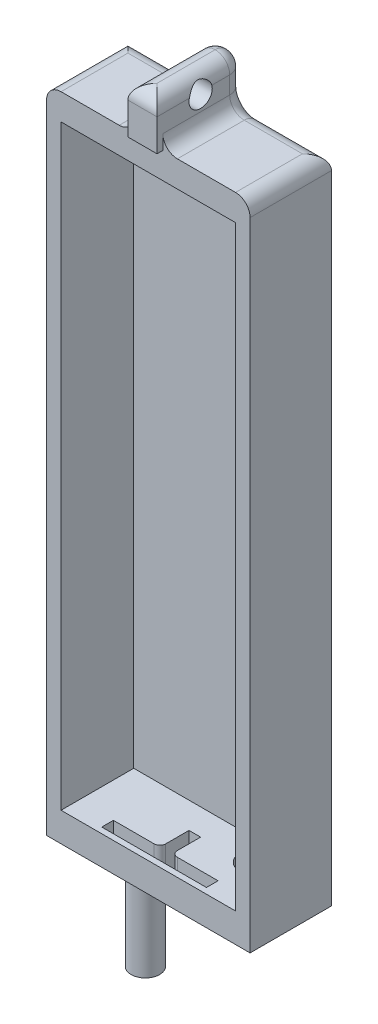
ISO-10303-21;
HEADER;
FILE_DESCRIPTION(('STEP AP214'),'2;1');
FILE_NAME('part.step','',(''),(''),'','','');
FILE_SCHEMA(('AUTOMOTIVE_DESIGN { 1 0 10303 214 1 1 1 1 }'));
ENDSEC;
DATA;
#1=APPLICATION_CONTEXT('core data for automotive mechanical design processes');
#2=APPLICATION_PROTOCOL_DEFINITION('international standard','automotive_design',2000,#1);
#3=PRODUCT_CONTEXT('',#1,'mechanical');
#4=PRODUCT('Part','Part','',(#3));
#5=PRODUCT_RELATED_PRODUCT_CATEGORY('part','',(#4));
#6=PRODUCT_DEFINITION_FORMATION('','',#4);
#7=PRODUCT_DEFINITION_CONTEXT('part definition',#1,'design');
#8=PRODUCT_DEFINITION('design','',#6,#7);
#9=PRODUCT_DEFINITION_SHAPE('','',#8);
#10=(LENGTH_UNIT() NAMED_UNIT(*) SI_UNIT(.MILLI.,.METRE.));
#11=(NAMED_UNIT(*) PLANE_ANGLE_UNIT() SI_UNIT($,.RADIAN.));
#12=(NAMED_UNIT(*) SI_UNIT($,.STERADIAN.) SOLID_ANGLE_UNIT());
#13=UNCERTAINTY_MEASURE_WITH_UNIT(LENGTH_MEASURE(1.E-05),#10,'distance_accuracy_value','');
#14=(GEOMETRIC_REPRESENTATION_CONTEXT(3) GLOBAL_UNCERTAINTY_ASSIGNED_CONTEXT((#13)) GLOBAL_UNIT_ASSIGNED_CONTEXT((#10,
#11,#12)) REPRESENTATION_CONTEXT('',''));
#15=CARTESIAN_POINT('',(0.,0.,0.));
#16=DIRECTION('',(0.,0.,1.));
#17=DIRECTION('',(1.,0.,0.));
#18=AXIS2_PLACEMENT_3D('',#15,#16,#17);
#19=CARTESIAN_POINT('',(0.,0.,15.));
#20=DIRECTION('',(0.,0.,-1.));
#21=DIRECTION('',(-1.,0.,0.));
#22=AXIS2_PLACEMENT_3D('',#19,#20,#21);
#23=PLANE('',#22);
#24=DIRECTION('',(0.,-1.,0.));
#25=VECTOR('',#24,1.);
#26=CARTESIAN_POINT('',(2.5,57.,15.));
#27=LINE('',#26,#25);
#28=CARTESIAN_POINT('',(2.5,62.5,15.));
#29=VERTEX_POINT('',#28);
#30=CARTESIAN_POINT('',(2.5,57.,15.));
#31=VERTEX_POINT('',#30);
#32=EDGE_CURVE('E363',#29,#31,#27,.T.);
#33=ORIENTED_EDGE('',*,*,#32,.F.);
#34=DIRECTION('',(1.,0.,0.));
#35=VECTOR('',#34,1.);
#36=CARTESIAN_POINT('',(-2.5,62.5,15.));
#37=LINE('',#36,#35);
#38=CARTESIAN_POINT('',(-2.5,62.5,15.));
#39=VERTEX_POINT('',#38);
#40=EDGE_CURVE('E717',#29,#39,#37,.F.);
#41=ORIENTED_EDGE('',*,*,#40,.T.);
#42=DIRECTION('',(0.,-1.,0.));
#43=VECTOR('',#42,1.);
#44=CARTESIAN_POINT('',(-2.5,57.,15.));
#45=LINE('',#44,#43);
#46=CARTESIAN_POINT('',(-2.5,57.,15.));
#47=VERTEX_POINT('',#46);
#48=EDGE_CURVE('E87',#39,#47,#45,.T.);
#49=ORIENTED_EDGE('',*,*,#48,.T.);
#50=DIRECTION('',(-1.,0.,0.));
#51=VECTOR('',#50,1.);
#52=CARTESIAN_POINT('',(-17.5,57.,15.));
#53=LINE('',#52,#51);
#54=EDGE_CURVE('E367',#31,#47,#53,.T.);
#55=ORIENTED_EDGE('',*,*,#54,.F.);
#56=EDGE_LOOP('',(#33,#41,#49,#55));
#57=FACE_BOUND('',#56,.T.);
#58=ADVANCED_FACE('F39',(#57),#23,.F.);
#59=CARTESIAN_POINT('',(-17.5,57.,14.));
#60=DIRECTION('',(0.,1.,0.));
#61=DIRECTION('',(0.,0.,1.));
#62=AXIS2_PLACEMENT_3D('',#59,#60,#61);
#63=PLANE('',#62);
#64=DIRECTION('',(0.,0.,-1.));
#65=VECTOR('',#64,1.);
#66=CARTESIAN_POINT('',(-2.5,57.,0.));
#67=LINE('',#66,#65);
#68=CARTESIAN_POINT('',(-2.5,57.,14.));
#69=VERTEX_POINT('',#68);
#70=EDGE_CURVE('E356',#47,#69,#67,.T.);
#71=ORIENTED_EDGE('',*,*,#70,.T.);
#72=DIRECTION('',(-1.,0.,0.));
#73=VECTOR('',#72,1.);
#74=CARTESIAN_POINT('',(-17.5,57.,14.));
#75=LINE('',#74,#73);
#76=CARTESIAN_POINT('',(2.5,57.,14.));
#77=VERTEX_POINT('',#76);
#78=EDGE_CURVE('E374',#77,#69,#75,.T.);
#79=ORIENTED_EDGE('',*,*,#78,.F.);
#80=DIRECTION('',(0.,0.,-1.));
#81=VECTOR('',#80,1.);
#82=CARTESIAN_POINT('',(2.5,57.,0.));
#83=LINE('',#82,#81);
#84=EDGE_CURVE('E365',#31,#77,#83,.T.);
#85=ORIENTED_EDGE('',*,*,#84,.F.);
#86=ORIENTED_EDGE('',*,*,#54,.T.);
#87=EDGE_LOOP('',(#71,#79,#85,#86));
#88=FACE_BOUND('',#87,.T.);
#89=ADVANCED_FACE('F578',(#88),#63,.F.);
#90=CARTESIAN_POINT('',(0.,0.,0.));
#91=DIRECTION('',(0.,0.,-1.));
#92=DIRECTION('',(-1.,0.,0.));
#93=AXIS2_PLACEMENT_3D('',#90,#91,#92);
#94=PLANE('',#93);
#95=DIRECTION('',(0.,-1.,0.));
#96=VECTOR('',#95,1.);
#97=CARTESIAN_POINT('',(-17.5,-55.,0.));
#98=LINE('',#97,#96);
#99=CARTESIAN_POINT('',(-17.5,54.5,0.));
#100=VERTEX_POINT('',#99);
#101=CARTESIAN_POINT('',(-17.5,-55.,0.));
#102=VERTEX_POINT('',#101);
#103=EDGE_CURVE('E470',#100,#102,#98,.T.);
#104=ORIENTED_EDGE('',*,*,#103,.F.);
#105=DIRECTION('',(-1.,0.,0.));
#106=VECTOR('',#105,1.);
#107=CARTESIAN_POINT('',(0.,54.5,0.));
#108=LINE('',#107,#106);
#109=CARTESIAN_POINT('',(-5.,54.5,0.));
#110=VERTEX_POINT('',#109);
#111=EDGE_CURVE('E527',#100,#110,#108,.F.);
#112=ORIENTED_EDGE('',*,*,#111,.T.);
#113=CARTESIAN_POINT('',(-5.,59.5,0.));
#114=DIRECTION('',(0.,0.,-1.));
#115=DIRECTION('',(-1.,0.,0.));
#116=AXIS2_PLACEMENT_3D('',#113,#114,#115);
#117=CIRCLE('',#116,5.);
#118=CARTESIAN_POINT('',(0.,59.5,0.));
#119=VERTEX_POINT('',#118);
#120=EDGE_CURVE('E524',#119,#110,#117,.T.);
#121=ORIENTED_EDGE('',*,*,#120,.F.);
#122=CARTESIAN_POINT('',(5.,59.5,0.));
#123=DIRECTION('',(0.,0.,-1.));
#124=DIRECTION('',(-1.,0.,0.));
#125=AXIS2_PLACEMENT_3D('',#122,#123,#124);
#126=CIRCLE('',#125,5.);
#127=CARTESIAN_POINT('',(5.,54.5,0.));
#128=VERTEX_POINT('',#127);
#129=EDGE_CURVE('E521',#128,#119,#126,.T.);
#130=ORIENTED_EDGE('',*,*,#129,.F.);
#131=DIRECTION('',(1.,0.,0.));
#132=VECTOR('',#131,1.);
#133=CARTESIAN_POINT('',(17.5,54.5,0.));
#134=LINE('',#133,#132);
#135=CARTESIAN_POINT('',(17.5,54.5,0.));
#136=VERTEX_POINT('',#135);
#137=EDGE_CURVE('E519',#128,#136,#134,.T.);
#138=ORIENTED_EDGE('',*,*,#137,.T.);
#139=DIRECTION('',(0.,1.,0.));
#140=VECTOR('',#139,1.);
#141=CARTESIAN_POINT('',(17.5,-55.,0.));
#142=LINE('',#141,#140);
#143=CARTESIAN_POINT('',(17.5,-55.,0.));
#144=VERTEX_POINT('',#143);
#145=EDGE_CURVE('E274',#144,#136,#142,.T.);
#146=ORIENTED_EDGE('',*,*,#145,.F.);
#147=DIRECTION('',(1.,0.,0.));
#148=VECTOR('',#147,1.);
#149=CARTESIAN_POINT('',(-17.5,-55.,0.));
#150=LINE('',#149,#148);
#151=EDGE_CURVE('E472',#102,#144,#150,.T.);
#152=ORIENTED_EDGE('',*,*,#151,.F.);
#153=EDGE_LOOP('',(#104,#112,#121,#130,#138,#146,#152));
#154=FACE_BOUND('',#153,.T.);
#155=ADVANCED_FACE('F581',(#154),#94,.T.);
#156=CARTESIAN_POINT('',(5.00000000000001,-50.,-106.800046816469));
#157=DIRECTION('',(0.,-1.,0.));
#158=DIRECTION('',(0.,0.,-1.));
#159=AXIS2_PLACEMENT_3D('',#156,#157,#158);
#160=PLANE('',#159);
#161=CARTESIAN_POINT('',(9.5,-50.,5.));
#162=DIRECTION('',(0.,-1.,0.));
#163=DIRECTION('',(0.,0.,-1.));
#164=AXIS2_PLACEMENT_3D('',#161,#162,#163);
#165=CIRCLE('',#164,2.75);
#166=CARTESIAN_POINT('',(9.5,-50.,2.25));
#167=VERTEX_POINT('',#166);
#168=EDGE_CURVE('E440',#167,#167,#165,.F.);
#169=ORIENTED_EDGE('',*,*,#168,.F.);
#170=EDGE_LOOP('',(#169));
#171=FACE_BOUND('',#170,.T.);
#172=DIRECTION('',(0.,0.,-1.));
#173=VECTOR('',#172,1.);
#174=CARTESIAN_POINT('',(1.,-50.,6.));
#175=LINE('',#174,#173);
#176=CARTESIAN_POINT('',(0.999999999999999,-50.,10.));
#177=VERTEX_POINT('',#176);
#178=CARTESIAN_POINT('',(1.,-50.,6.));
#179=VERTEX_POINT('',#178);
#180=EDGE_CURVE('E396',#177,#179,#175,.T.);
#181=ORIENTED_EDGE('',*,*,#180,.F.);
#182=CARTESIAN_POINT('',(2.,-50.,10.));
#183=DIRECTION('',(0.,-1.,0.));
#184=DIRECTION('',(0.,0.,-1.));
#185=AXIS2_PLACEMENT_3D('',#182,#183,#184);
#186=CIRCLE('',#185,1.);
#187=CARTESIAN_POINT('',(2.,-50.,11.));
#188=VERTEX_POINT('',#187);
#189=EDGE_CURVE('E491',#177,#188,#186,.F.);
#190=ORIENTED_EDGE('',*,*,#189,.T.);
#191=DIRECTION('',(-1.,0.,0.));
#192=VECTOR('',#191,1.);
#193=CARTESIAN_POINT('',(9.,-50.,11.));
#194=LINE('',#193,#192);
#195=CARTESIAN_POINT('',(9.,-50.,11.));
#196=VERTEX_POINT('',#195);
#197=EDGE_CURVE('E398',#196,#188,#194,.T.);
#198=ORIENTED_EDGE('',*,*,#197,.F.);
#199=DIRECTION('',(0.,0.,-1.));
#200=VECTOR('',#199,1.);
#201=CARTESIAN_POINT('',(9.,-50.,11.));
#202=LINE('',#201,#200);
#203=CARTESIAN_POINT('',(9.,-50.,13.));
#204=VERTEX_POINT('',#203);
#205=EDGE_CURVE('E401',#204,#196,#202,.T.);
#206=ORIENTED_EDGE('',*,*,#205,.F.);
#207=DIRECTION('',(1.,0.,0.));
#208=VECTOR('',#207,1.);
#209=CARTESIAN_POINT('',(9.,-50.,13.));
#210=LINE('',#209,#208);
#211=CARTESIAN_POINT('',(-9.,-50.,13.));
#212=VERTEX_POINT('',#211);
#213=EDGE_CURVE('E403',#212,#204,#210,.T.);
#214=ORIENTED_EDGE('',*,*,#213,.F.);
#215=DIRECTION('',(0.,0.,1.));
#216=VECTOR('',#215,1.);
#217=CARTESIAN_POINT('',(-9.,-50.,11.));
#218=LINE('',#217,#216);
#219=CARTESIAN_POINT('',(-9.,-50.,11.));
#220=VERTEX_POINT('',#219);
#221=EDGE_CURVE('E385',#220,#212,#218,.T.);
#222=ORIENTED_EDGE('',*,*,#221,.F.);
#223=DIRECTION('',(-1.,0.,0.));
#224=VECTOR('',#223,1.);
#225=CARTESIAN_POINT('',(-0.999999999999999,-50.,11.));
#226=LINE('',#225,#224);
#227=CARTESIAN_POINT('',(-2.,-50.,11.));
#228=VERTEX_POINT('',#227);
#229=EDGE_CURVE('E388',#228,#220,#226,.T.);
#230=ORIENTED_EDGE('',*,*,#229,.F.);
#231=CARTESIAN_POINT('',(-2.,-50.,10.));
#232=DIRECTION('',(0.,-1.,0.));
#233=DIRECTION('',(0.,0.,-1.));
#234=AXIS2_PLACEMENT_3D('',#231,#232,#233);
#235=CIRCLE('',#234,1.);
#236=CARTESIAN_POINT('',(-0.999999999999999,-50.,10.));
#237=VERTEX_POINT('',#236);
#238=EDGE_CURVE('E489',#228,#237,#235,.F.);
#239=ORIENTED_EDGE('',*,*,#238,.T.);
#240=DIRECTION('',(0.,0.,1.));
#241=VECTOR('',#240,1.);
#242=CARTESIAN_POINT('',(-1.,-50.,6.));
#243=LINE('',#242,#241);
#244=CARTESIAN_POINT('',(-1.,-50.,6.));
#245=VERTEX_POINT('',#244);
#246=EDGE_CURVE('E391',#245,#237,#243,.T.);
#247=ORIENTED_EDGE('',*,*,#246,.F.);
#248=DIRECTION('',(-1.,0.,0.));
#249=VECTOR('',#248,1.);
#250=CARTESIAN_POINT('',(1.,-50.,6.));
#251=LINE('',#250,#249);
#252=EDGE_CURVE('E394',#179,#245,#251,.T.);
#253=ORIENTED_EDGE('',*,*,#252,.F.);
#254=EDGE_LOOP('',(#181,#190,#198,#206,#214,#222,#230,#239,#247,#253));
#255=FACE_BOUND('',#254,.T.);
#256=DIRECTION('',(-1.,0.,0.));
#257=VECTOR('',#256,1.);
#258=CARTESIAN_POINT('',(5.00000000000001,-50.,14.));
#259=LINE('',#258,#257);
#260=CARTESIAN_POINT('',(15.,-50.,14.));
#261=VERTEX_POINT('',#260);
#262=CARTESIAN_POINT('',(-15.,-50.,14.));
#263=VERTEX_POINT('',#262);
#264=EDGE_CURVE('E382',#261,#263,#259,.T.);
#265=ORIENTED_EDGE('',*,*,#264,.F.);
#266=DIRECTION('',(0.,0.,1.));
#267=VECTOR('',#266,1.);
#268=CARTESIAN_POINT('',(15.,-50.,-106.800046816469));
#269=LINE('',#268,#267);
#270=CARTESIAN_POINT('',(15.,-50.,1.5));
#271=VERTEX_POINT('',#270);
#272=EDGE_CURVE('E448',#271,#261,#269,.T.);
#273=ORIENTED_EDGE('',*,*,#272,.F.);
#274=DIRECTION('',(1.,0.,0.));
#275=VECTOR('',#274,1.);
#276=CARTESIAN_POINT('',(5.00000000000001,-50.,1.5));
#277=LINE('',#276,#275);
#278=CARTESIAN_POINT('',(-15.,-50.,1.5));
#279=VERTEX_POINT('',#278);
#280=EDGE_CURVE('E443',#279,#271,#277,.T.);
#281=ORIENTED_EDGE('',*,*,#280,.F.);
#282=DIRECTION('',(0.,0.,1.));
#283=VECTOR('',#282,1.);
#284=CARTESIAN_POINT('',(-15.,-50.,-106.800046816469));
#285=LINE('',#284,#283);
#286=EDGE_CURVE('E452',#279,#263,#285,.T.);
#287=ORIENTED_EDGE('',*,*,#286,.T.);
#288=EDGE_LOOP('',(#265,#273,#281,#287));
#289=FACE_BOUND('',#288,.T.);
#290=ADVANCED_FACE('F632',(#171,#255,#289),#160,.F.);
#291=CARTESIAN_POINT('',(17.5,-55.,15.));
#292=DIRECTION('',(-1.,0.,0.));
#293=DIRECTION('',(0.,0.,1.));
#294=AXIS2_PLACEMENT_3D('',#291,#292,#293);
#295=PLANE('',#294);
#296=ORIENTED_EDGE('',*,*,#145,.T.);
#297=DIRECTION('',(0.,0.,1.));
#298=VECTOR('',#297,1.);
#299=CARTESIAN_POINT('',(17.5,54.5,15.));
#300=LINE('',#299,#298);
#301=CARTESIAN_POINT('',(17.5,54.5,14.));
#302=VERTEX_POINT('',#301);
#303=EDGE_CURVE('E268',#136,#302,#300,.T.);
#304=ORIENTED_EDGE('',*,*,#303,.T.);
#305=DIRECTION('',(0.,1.,0.));
#306=VECTOR('',#305,1.);
#307=CARTESIAN_POINT('',(17.5,57.,14.));
#308=LINE('',#307,#306);
#309=CARTESIAN_POINT('',(17.5,-55.,14.));
#310=VERTEX_POINT('',#309);
#311=EDGE_CURVE('E271',#310,#302,#308,.T.);
#312=ORIENTED_EDGE('',*,*,#311,.F.);
#313=DIRECTION('',(0.,0.,-1.));
#314=VECTOR('',#313,1.);
#315=CARTESIAN_POINT('',(17.5,-55.,15.));
#316=LINE('',#315,#314);
#317=EDGE_CURVE('E475',#310,#144,#316,.T.);
#318=ORIENTED_EDGE('',*,*,#317,.T.);
#319=EDGE_LOOP('',(#296,#304,#312,#318));
#320=FACE_BOUND('',#319,.T.);
#321=ADVANCED_FACE('F270',(#320),#295,.F.);
#322=CARTESIAN_POINT('',(-17.5,-55.,15.));
#323=DIRECTION('',(1.,0.,0.));
#324=DIRECTION('',(0.,0.,-1.));
#325=AXIS2_PLACEMENT_3D('',#322,#323,#324);
#326=PLANE('',#325);
#327=DIRECTION('',(0.,-1.,0.));
#328=VECTOR('',#327,1.);
#329=CARTESIAN_POINT('',(-17.5,57.,14.));
#330=LINE('',#329,#328);
#331=CARTESIAN_POINT('',(-17.5,54.5,14.));
#332=VERTEX_POINT('',#331);
#333=CARTESIAN_POINT('',(-17.5,-55.,14.));
#334=VERTEX_POINT('',#333);
#335=EDGE_CURVE('E368',#332,#334,#330,.T.);
#336=ORIENTED_EDGE('',*,*,#335,.F.);
#337=DIRECTION('',(0.,0.,-1.));
#338=VECTOR('',#337,1.);
#339=CARTESIAN_POINT('',(-17.5,54.5,0.));
#340=LINE('',#339,#338);
#341=EDGE_CURVE('E293',#332,#100,#340,.T.);
#342=ORIENTED_EDGE('',*,*,#341,.T.);
#343=ORIENTED_EDGE('',*,*,#103,.T.);
#344=DIRECTION('',(0.,0.,-1.));
#345=VECTOR('',#344,1.);
#346=CARTESIAN_POINT('',(-17.5,-55.,15.));
#347=LINE('',#346,#345);
#348=EDGE_CURVE('E477',#334,#102,#347,.T.);
#349=ORIENTED_EDGE('',*,*,#348,.F.);
#350=EDGE_LOOP('',(#336,#342,#343,#349));
#351=FACE_BOUND('',#350,.T.);
#352=ADVANCED_FACE('F646',(#351),#326,.F.);
#353=CARTESIAN_POINT('',(-17.5,-55.,15.));
#354=DIRECTION('',(0.,1.,0.));
#355=DIRECTION('',(0.,0.,1.));
#356=AXIS2_PLACEMENT_3D('',#353,#354,#355);
#357=PLANE('',#356);
#358=CARTESIAN_POINT('',(-9.5,-55.,5.));
#359=DIRECTION('',(0.,1.,0.));
#360=DIRECTION('',(0.,0.,1.));
#361=AXIS2_PLACEMENT_3D('',#358,#359,#360);
#362=CIRCLE('',#361,2.45);
#363=CARTESIAN_POINT('',(-9.5,-55.,7.45));
#364=VERTEX_POINT('',#363);
#365=EDGE_CURVE('E12',#364,#364,#362,.F.);
#366=ORIENTED_EDGE('',*,*,#365,.F.);
#367=EDGE_LOOP('',(#366));
#368=FACE_BOUND('',#367,.T.);
#369=CARTESIAN_POINT('',(9.5,-55.,5.));
#370=DIRECTION('',(0.,-1.,0.));
#371=DIRECTION('',(0.,0.,-1.));
#372=AXIS2_PLACEMENT_3D('',#369,#370,#371);
#373=CIRCLE('',#372,2.75);
#374=CARTESIAN_POINT('',(9.5,-55.,2.25));
#375=VERTEX_POINT('',#374);
#376=EDGE_CURVE('E439',#375,#375,#373,.T.);
#377=ORIENTED_EDGE('',*,*,#376,.F.);
#378=EDGE_LOOP('',(#377));
#379=FACE_BOUND('',#378,.T.);
#380=DIRECTION('',(1.,0.,0.));
#381=VECTOR('',#380,1.);
#382=CARTESIAN_POINT('',(9.,-55.,11.));
#383=LINE('',#382,#381);
#384=CARTESIAN_POINT('',(2.,-55.,11.));
#385=VERTEX_POINT('',#384);
#386=CARTESIAN_POINT('',(9.,-55.,11.));
#387=VERTEX_POINT('',#386);
#388=EDGE_CURVE('E422',#385,#387,#383,.T.);
#389=ORIENTED_EDGE('',*,*,#388,.F.);
#390=CARTESIAN_POINT('',(2.,-55.,10.));
#391=DIRECTION('',(0.,1.,0.));
#392=DIRECTION('',(0.,0.,1.));
#393=AXIS2_PLACEMENT_3D('',#390,#391,#392);
#394=CIRCLE('',#393,1.);
#395=CARTESIAN_POINT('',(0.999999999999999,-55.,10.));
#396=VERTEX_POINT('',#395);
#397=EDGE_CURVE('E485',#385,#396,#394,.F.);
#398=ORIENTED_EDGE('',*,*,#397,.T.);
#399=DIRECTION('',(0.,0.,1.));
#400=VECTOR('',#399,1.);
#401=CARTESIAN_POINT('',(1.,-55.,6.));
#402=LINE('',#401,#400);
#403=CARTESIAN_POINT('',(1.,-55.,6.));
#404=VERTEX_POINT('',#403);
#405=EDGE_CURVE('E419',#404,#396,#402,.T.);
#406=ORIENTED_EDGE('',*,*,#405,.F.);
#407=DIRECTION('',(1.,0.,0.));
#408=VECTOR('',#407,1.);
#409=CARTESIAN_POINT('',(1.,-55.,6.));
#410=LINE('',#409,#408);
#411=CARTESIAN_POINT('',(-1.,-55.,6.));
#412=VERTEX_POINT('',#411);
#413=EDGE_CURVE('E416',#412,#404,#410,.T.);
#414=ORIENTED_EDGE('',*,*,#413,.F.);
#415=DIRECTION('',(0.,0.,-1.));
#416=VECTOR('',#415,1.);
#417=CARTESIAN_POINT('',(-1.,-55.,6.));
#418=LINE('',#417,#416);
#419=CARTESIAN_POINT('',(-0.999999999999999,-55.,10.));
#420=VERTEX_POINT('',#419);
#421=EDGE_CURVE('E414',#420,#412,#418,.T.);
#422=ORIENTED_EDGE('',*,*,#421,.F.);
#423=CARTESIAN_POINT('',(-2.,-55.,10.));
#424=DIRECTION('',(0.,1.,0.));
#425=DIRECTION('',(0.,0.,1.));
#426=AXIS2_PLACEMENT_3D('',#423,#424,#425);
#427=CIRCLE('',#426,1.);
#428=CARTESIAN_POINT('',(-2.,-55.,11.));
#429=VERTEX_POINT('',#428);
#430=EDGE_CURVE('E483',#420,#429,#427,.F.);
#431=ORIENTED_EDGE('',*,*,#430,.T.);
#432=DIRECTION('',(1.,0.,0.));
#433=VECTOR('',#432,1.);
#434=CARTESIAN_POINT('',(-0.999999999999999,-55.,11.));
#435=LINE('',#434,#433);
#436=CARTESIAN_POINT('',(-9.,-55.,11.));
#437=VERTEX_POINT('',#436);
#438=EDGE_CURVE('E411',#437,#429,#435,.T.);
#439=ORIENTED_EDGE('',*,*,#438,.F.);
#440=DIRECTION('',(0.,0.,-1.));
#441=VECTOR('',#440,1.);
#442=CARTESIAN_POINT('',(-9.,-55.,11.));
#443=LINE('',#442,#441);
#444=CARTESIAN_POINT('',(-9.,-55.,13.));
#445=VERTEX_POINT('',#444);
#446=EDGE_CURVE('E408',#445,#437,#443,.T.);
#447=ORIENTED_EDGE('',*,*,#446,.F.);
#448=DIRECTION('',(-1.,0.,0.));
#449=VECTOR('',#448,1.);
#450=CARTESIAN_POINT('',(9.,-55.,13.));
#451=LINE('',#450,#449);
#452=CARTESIAN_POINT('',(9.,-55.,13.));
#453=VERTEX_POINT('',#452);
#454=EDGE_CURVE('E405',#453,#445,#451,.T.);
#455=ORIENTED_EDGE('',*,*,#454,.F.);
#456=DIRECTION('',(0.,0.,1.));
#457=VECTOR('',#456,1.);
#458=CARTESIAN_POINT('',(9.,-55.,11.));
#459=LINE('',#458,#457);
#460=EDGE_CURVE('E384',#387,#453,#459,.T.);
#461=ORIENTED_EDGE('',*,*,#460,.F.);
#462=EDGE_LOOP('',(#389,#398,#406,#414,#422,#431,#439,#447,#455,#461));
#463=FACE_BOUND('',#462,.T.);
#464=DIRECTION('',(1.,0.,0.));
#465=VECTOR('',#464,1.);
#466=CARTESIAN_POINT('',(-17.5,-55.,14.));
#467=LINE('',#466,#465);
#468=EDGE_CURVE('E288',#334,#310,#467,.T.);
#469=ORIENTED_EDGE('',*,*,#468,.F.);
#470=ORIENTED_EDGE('',*,*,#348,.T.);
#471=ORIENTED_EDGE('',*,*,#151,.T.);
#472=ORIENTED_EDGE('',*,*,#317,.F.);
#473=EDGE_LOOP('',(#469,#470,#471,#472));
#474=FACE_BOUND('',#473,.T.);
#475=ADVANCED_FACE('F630',(#368,#379,#463,#474),#357,.F.);
#476=CARTESIAN_POINT('',(15.,52.5,-106.800046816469));
#477=DIRECTION('',(1.,0.,0.));
#478=DIRECTION('',(0.,1.,0.));
#479=AXIS2_PLACEMENT_3D('',#476,#477,#478);
#480=PLANE('',#479);
#481=DIRECTION('',(0.,-1.,0.));
#482=VECTOR('',#481,1.);
#483=CARTESIAN_POINT('',(15.,52.5,14.));
#484=LINE('',#483,#482);
#485=CARTESIAN_POINT('',(15.,52.5,14.));
#486=VERTEX_POINT('',#485);
#487=EDGE_CURVE('E380',#486,#261,#484,.T.);
#488=ORIENTED_EDGE('',*,*,#487,.F.);
#489=DIRECTION('',(0.,0.,1.));
#490=VECTOR('',#489,1.);
#491=CARTESIAN_POINT('',(15.,52.5,-106.800046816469));
#492=LINE('',#491,#490);
#493=CARTESIAN_POINT('',(15.,52.5,1.5));
#494=VERTEX_POINT('',#493);
#495=EDGE_CURVE('E457',#494,#486,#492,.T.);
#496=ORIENTED_EDGE('',*,*,#495,.F.);
#497=DIRECTION('',(0.,1.,0.));
#498=VECTOR('',#497,1.);
#499=CARTESIAN_POINT('',(15.,52.5,1.5));
#500=LINE('',#499,#498);
#501=EDGE_CURVE('E458',#271,#494,#500,.T.);
#502=ORIENTED_EDGE('',*,*,#501,.F.);
#503=ORIENTED_EDGE('',*,*,#272,.T.);
#504=EDGE_LOOP('',(#488,#496,#502,#503));
#505=FACE_BOUND('',#504,.T.);
#506=ADVANCED_FACE('F626',(#505),#480,.F.);
#507=CARTESIAN_POINT('',(-15.,52.5,-106.800046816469));
#508=DIRECTION('',(0.,1.,0.));
#509=DIRECTION('',(0.,0.,1.));
#510=AXIS2_PLACEMENT_3D('',#507,#508,#509);
#511=PLANE('',#510);
#512=DIRECTION('',(1.,0.,0.));
#513=VECTOR('',#512,1.);
#514=CARTESIAN_POINT('',(-15.,52.5,14.));
#515=LINE('',#514,#513);
#516=CARTESIAN_POINT('',(-15.,52.5,14.));
#517=VERTEX_POINT('',#516);
#518=EDGE_CURVE('E378',#517,#486,#515,.T.);
#519=ORIENTED_EDGE('',*,*,#518,.F.);
#520=DIRECTION('',(0.,0.,1.));
#521=VECTOR('',#520,1.);
#522=CARTESIAN_POINT('',(-15.,52.5,-106.800046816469));
#523=LINE('',#522,#521);
#524=CARTESIAN_POINT('',(-15.,52.5,1.5));
#525=VERTEX_POINT('',#524);
#526=EDGE_CURVE('E453',#525,#517,#523,.T.);
#527=ORIENTED_EDGE('',*,*,#526,.F.);
#528=DIRECTION('',(-1.,0.,0.));
#529=VECTOR('',#528,1.);
#530=CARTESIAN_POINT('',(-15.,52.5,1.5));
#531=LINE('',#530,#529);
#532=EDGE_CURVE('E454',#494,#525,#531,.T.);
#533=ORIENTED_EDGE('',*,*,#532,.F.);
#534=ORIENTED_EDGE('',*,*,#495,.T.);
#535=EDGE_LOOP('',(#519,#527,#533,#534));
#536=FACE_BOUND('',#535,.T.);
#537=ADVANCED_FACE('F622',(#536),#511,.F.);
#538=CARTESIAN_POINT('',(-15.,52.5,-106.800046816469));
#539=DIRECTION('',(-1.,0.,0.));
#540=DIRECTION('',(0.,-1.,0.));
#541=AXIS2_PLACEMENT_3D('',#538,#539,#540);
#542=PLANE('',#541);
#543=DIRECTION('',(0.,1.,0.));
#544=VECTOR('',#543,1.);
#545=CARTESIAN_POINT('',(-15.,52.5,14.));
#546=LINE('',#545,#544);
#547=EDGE_CURVE('E373',#263,#517,#546,.T.);
#548=ORIENTED_EDGE('',*,*,#547,.F.);
#549=ORIENTED_EDGE('',*,*,#286,.F.);
#550=DIRECTION('',(0.,-1.,0.));
#551=VECTOR('',#550,1.);
#552=CARTESIAN_POINT('',(-15.,52.5,1.5));
#553=LINE('',#552,#551);
#554=EDGE_CURVE('E449',#525,#279,#553,.T.);
#555=ORIENTED_EDGE('',*,*,#554,.F.);
#556=ORIENTED_EDGE('',*,*,#526,.T.);
#557=EDGE_LOOP('',(#548,#549,#555,#556));
#558=FACE_BOUND('',#557,.T.);
#559=ADVANCED_FACE('F619',(#558),#542,.F.);
#560=CARTESIAN_POINT('',(0.,0.,1.5));
#561=DIRECTION('',(0.,0.,-1.));
#562=DIRECTION('',(-1.,0.,0.));
#563=AXIS2_PLACEMENT_3D('',#560,#561,#562);
#564=PLANE('',#563);
#565=ORIENTED_EDGE('',*,*,#554,.T.);
#566=ORIENTED_EDGE('',*,*,#280,.T.);
#567=ORIENTED_EDGE('',*,*,#501,.T.);
#568=ORIENTED_EDGE('',*,*,#532,.T.);
#569=EDGE_LOOP('',(#565,#566,#567,#568));
#570=FACE_BOUND('',#569,.T.);
#571=ADVANCED_FACE('F617',(#570),#564,.F.);
#572=CARTESIAN_POINT('',(9.5,-55.,5.));
#573=DIRECTION('',(0.,-1.,0.));
#574=DIRECTION('',(0.,0.,-1.));
#575=AXIS2_PLACEMENT_3D('',#572,#573,#574);
#576=CYLINDRICAL_SURFACE('',#575,2.75);
#577=ORIENTED_EDGE('',*,*,#168,.T.);
#578=EDGE_LOOP('',(#577));
#579=FACE_BOUND('',#578,.T.);
#580=ORIENTED_EDGE('',*,*,#376,.T.);
#581=EDGE_LOOP('',(#580));
#582=FACE_BOUND('',#581,.T.);
#583=ADVANCED_FACE('F613',(#579,#582),#576,.F.);
#584=CARTESIAN_POINT('',(9.,-30.6867920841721,11.));
#585=DIRECTION('',(1.,0.,0.));
#586=DIRECTION('',(0.,0.,-1.));
#587=AXIS2_PLACEMENT_3D('',#584,#585,#586);
#588=PLANE('',#587);
#589=ORIENTED_EDGE('',*,*,#205,.T.);
#590=DIRECTION('',(0.,-1.,0.));
#591=VECTOR('',#590,1.);
#592=CARTESIAN_POINT('',(9.,-30.6867920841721,11.));
#593=LINE('',#592,#591);
#594=EDGE_CURVE('E389',#196,#387,#593,.T.);
#595=ORIENTED_EDGE('',*,*,#594,.T.);
#596=ORIENTED_EDGE('',*,*,#460,.T.);
#597=DIRECTION('',(0.,-1.,0.));
#598=VECTOR('',#597,1.);
#599=CARTESIAN_POINT('',(9.,-30.6867920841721,13.));
#600=LINE('',#599,#598);
#601=EDGE_CURVE('E424',#204,#453,#600,.T.);
#602=ORIENTED_EDGE('',*,*,#601,.F.);
#603=EDGE_LOOP('',(#589,#595,#596,#602));
#604=FACE_BOUND('',#603,.T.);
#605=ADVANCED_FACE('F587',(#604),#588,.F.);
#606=CARTESIAN_POINT('',(9.,-30.6867920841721,11.));
#607=DIRECTION('',(0.,0.,-1.));
#608=DIRECTION('',(-1.,0.,0.));
#609=AXIS2_PLACEMENT_3D('',#606,#607,#608);
#610=PLANE('',#609);
#611=ORIENTED_EDGE('',*,*,#197,.T.);
#612=DIRECTION('',(0.,-1.,0.));
#613=VECTOR('',#612,1.);
#614=CARTESIAN_POINT('',(2.,-30.6867920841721,11.));
#615=LINE('',#614,#613);
#616=EDGE_CURVE('E480',#188,#385,#615,.T.);
#617=ORIENTED_EDGE('',*,*,#616,.T.);
#618=ORIENTED_EDGE('',*,*,#388,.T.);
#619=ORIENTED_EDGE('',*,*,#594,.F.);
#620=EDGE_LOOP('',(#611,#617,#618,#619));
#621=FACE_BOUND('',#620,.T.);
#622=ADVANCED_FACE('F583',(#621),#610,.F.);
#623=CARTESIAN_POINT('',(1.,-30.6867920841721,6.));
#624=DIRECTION('',(1.,0.,0.));
#625=DIRECTION('',(0.,0.,-1.));
#626=AXIS2_PLACEMENT_3D('',#623,#624,#625);
#627=PLANE('',#626);
#628=ORIENTED_EDGE('',*,*,#405,.T.);
#629=DIRECTION('',(0.,-1.,0.));
#630=VECTOR('',#629,1.);
#631=CARTESIAN_POINT('',(0.999999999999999,-30.6867920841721,10.));
#632=LINE('',#631,#630);
#633=EDGE_CURVE('E487',#396,#177,#632,.F.);
#634=ORIENTED_EDGE('',*,*,#633,.T.);
#635=ORIENTED_EDGE('',*,*,#180,.T.);
#636=DIRECTION('',(0.,-1.,0.));
#637=VECTOR('',#636,1.);
#638=CARTESIAN_POINT('',(1.,-30.6867920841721,6.));
#639=LINE('',#638,#637);
#640=EDGE_CURVE('E427',#179,#404,#639,.T.);
#641=ORIENTED_EDGE('',*,*,#640,.T.);
#642=EDGE_LOOP('',(#628,#634,#635,#641));
#643=FACE_BOUND('',#642,.T.);
#644=ADVANCED_FACE('F586',(#643),#627,.F.);
#645=CARTESIAN_POINT('',(1.,-30.6867920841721,6.));
#646=DIRECTION('',(0.,0.,-1.));
#647=DIRECTION('',(-1.,0.,0.));
#648=AXIS2_PLACEMENT_3D('',#645,#646,#647);
#649=PLANE('',#648);
#650=ORIENTED_EDGE('',*,*,#252,.T.);
#651=DIRECTION('',(0.,-1.,0.));
#652=VECTOR('',#651,1.);
#653=CARTESIAN_POINT('',(-1.,-30.6867920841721,6.));
#654=LINE('',#653,#652);
#655=EDGE_CURVE('E429',#245,#412,#654,.T.);
#656=ORIENTED_EDGE('',*,*,#655,.T.);
#657=ORIENTED_EDGE('',*,*,#413,.T.);
#658=ORIENTED_EDGE('',*,*,#640,.F.);
#659=EDGE_LOOP('',(#650,#656,#657,#658));
#660=FACE_BOUND('',#659,.T.);
#661=ADVANCED_FACE('F591',(#660),#649,.F.);
#662=CARTESIAN_POINT('',(-1.,-30.6867920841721,6.));
#663=DIRECTION('',(-1.,0.,0.));
#664=DIRECTION('',(0.,0.,1.));
#665=AXIS2_PLACEMENT_3D('',#662,#663,#664);
#666=PLANE('',#665);
#667=ORIENTED_EDGE('',*,*,#246,.T.);
#668=DIRECTION('',(0.,-1.,0.));
#669=VECTOR('',#668,1.);
#670=CARTESIAN_POINT('',(-0.999999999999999,-30.6867920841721,10.));
#671=LINE('',#670,#669);
#672=EDGE_CURVE('E493',#237,#420,#671,.T.);
#673=ORIENTED_EDGE('',*,*,#672,.T.);
#674=ORIENTED_EDGE('',*,*,#421,.T.);
#675=ORIENTED_EDGE('',*,*,#655,.F.);
#676=EDGE_LOOP('',(#667,#673,#674,#675));
#677=FACE_BOUND('',#676,.T.);
#678=ADVANCED_FACE('F595',(#677),#666,.F.);
#679=CARTESIAN_POINT('',(-0.999999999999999,-30.6867920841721,11.));
#680=DIRECTION('',(0.,0.,-1.));
#681=DIRECTION('',(-1.,0.,0.));
#682=AXIS2_PLACEMENT_3D('',#679,#680,#681);
#683=PLANE('',#682);
#684=ORIENTED_EDGE('',*,*,#438,.T.);
#685=DIRECTION('',(0.,-1.,0.));
#686=VECTOR('',#685,1.);
#687=CARTESIAN_POINT('',(-2.,-30.6867920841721,11.));
#688=LINE('',#687,#686);
#689=EDGE_CURVE('E496',#429,#228,#688,.F.);
#690=ORIENTED_EDGE('',*,*,#689,.T.);
#691=ORIENTED_EDGE('',*,*,#229,.T.);
#692=DIRECTION('',(0.,-1.,0.));
#693=VECTOR('',#692,1.);
#694=CARTESIAN_POINT('',(-9.,-30.6867920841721,11.));
#695=LINE('',#694,#693);
#696=EDGE_CURVE('E432',#220,#437,#695,.T.);
#697=ORIENTED_EDGE('',*,*,#696,.T.);
#698=EDGE_LOOP('',(#684,#690,#691,#697));
#699=FACE_BOUND('',#698,.T.);
#700=ADVANCED_FACE('F599',(#699),#683,.F.);
#701=CARTESIAN_POINT('',(-9.,-30.6867920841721,11.));
#702=DIRECTION('',(-1.,0.,0.));
#703=DIRECTION('',(0.,0.,1.));
#704=AXIS2_PLACEMENT_3D('',#701,#702,#703);
#705=PLANE('',#704);
#706=ORIENTED_EDGE('',*,*,#221,.T.);
#707=DIRECTION('',(0.,-1.,0.));
#708=VECTOR('',#707,1.);
#709=CARTESIAN_POINT('',(-9.,-30.6867920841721,13.));
#710=LINE('',#709,#708);
#711=EDGE_CURVE('E434',#212,#445,#710,.T.);
#712=ORIENTED_EDGE('',*,*,#711,.T.);
#713=ORIENTED_EDGE('',*,*,#446,.T.);
#714=ORIENTED_EDGE('',*,*,#696,.F.);
#715=EDGE_LOOP('',(#706,#712,#713,#714));
#716=FACE_BOUND('',#715,.T.);
#717=ADVANCED_FACE('F603',(#716),#705,.F.);
#718=CARTESIAN_POINT('',(9.,-30.6867920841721,13.));
#719=DIRECTION('',(0.,0.,1.));
#720=DIRECTION('',(1.,0.,0.));
#721=AXIS2_PLACEMENT_3D('',#718,#719,#720);
#722=PLANE('',#721);
#723=ORIENTED_EDGE('',*,*,#213,.T.);
#724=ORIENTED_EDGE('',*,*,#601,.T.);
#725=ORIENTED_EDGE('',*,*,#454,.T.);
#726=ORIENTED_EDGE('',*,*,#711,.F.);
#727=EDGE_LOOP('',(#723,#724,#725,#726));
#728=FACE_BOUND('',#727,.T.);
#729=ADVANCED_FACE('F577',(#728),#722,.F.);
#730=CARTESIAN_POINT('',(0.,0.,14.));
#731=DIRECTION('',(0.,0.,1.));
#732=DIRECTION('',(1.,0.,0.));
#733=AXIS2_PLACEMENT_3D('',#730,#731,#732);
#734=PLANE('',#733);
#735=ORIENTED_EDGE('',*,*,#311,.T.);
#736=CARTESIAN_POINT('',(15.,54.5,14.));
#737=DIRECTION('',(0.,0.,1.));
#738=DIRECTION('',(1.,0.,0.));
#739=AXIS2_PLACEMENT_3D('',#736,#737,#738);
#740=CIRCLE('',#739,2.5);
#741=CARTESIAN_POINT('',(15.,57.,14.));
#742=VERTEX_POINT('',#741);
#743=EDGE_CURVE('E285',#302,#742,#740,.T.);
#744=ORIENTED_EDGE('',*,*,#743,.T.);
#745=CARTESIAN_POINT('',(5.,57.,14.));
#746=VERTEX_POINT('',#745);
#747=EDGE_CURVE('E371',#742,#746,#75,.T.);
#748=ORIENTED_EDGE('',*,*,#747,.T.);
#749=CARTESIAN_POINT('',(5.,59.5,14.));
#750=DIRECTION('',(0.,0.,1.));
#751=DIRECTION('',(1.,0.,0.));
#752=AXIS2_PLACEMENT_3D('',#749,#750,#751);
#753=CIRCLE('',#752,2.5);
#754=CARTESIAN_POINT('',(2.5,59.5,14.));
#755=VERTEX_POINT('',#754);
#756=EDGE_CURVE('E295',#746,#755,#753,.F.);
#757=ORIENTED_EDGE('',*,*,#756,.T.);
#758=DIRECTION('',(0.,1.,0.));
#759=VECTOR('',#758,1.);
#760=CARTESIAN_POINT('',(2.5,0.,14.));
#761=LINE('',#760,#759);
#762=EDGE_CURVE('E56',#77,#755,#761,.T.);
#763=ORIENTED_EDGE('',*,*,#762,.F.);
#764=ORIENTED_EDGE('',*,*,#78,.T.);
#765=DIRECTION('',(0.,-1.,0.));
#766=VECTOR('',#765,1.);
#767=CARTESIAN_POINT('',(-2.5,0.,14.));
#768=LINE('',#767,#766);
#769=CARTESIAN_POINT('',(-2.5,59.5,14.));
#770=VERTEX_POINT('',#769);
#771=EDGE_CURVE('E498',#770,#69,#768,.T.);
#772=ORIENTED_EDGE('',*,*,#771,.F.);
#773=CARTESIAN_POINT('',(-5.,59.5,14.));
#774=DIRECTION('',(0.,0.,1.));
#775=DIRECTION('',(1.,0.,0.));
#776=AXIS2_PLACEMENT_3D('',#773,#774,#775);
#777=CIRCLE('',#776,2.5);
#778=CARTESIAN_POINT('',(-5.,57.,14.));
#779=VERTEX_POINT('',#778);
#780=EDGE_CURVE('E48',#770,#779,#777,.F.);
#781=ORIENTED_EDGE('',*,*,#780,.T.);
#782=CARTESIAN_POINT('',(-15.,57.,14.));
#783=VERTEX_POINT('',#782);
#784=EDGE_CURVE('E289',#779,#783,#75,.T.);
#785=ORIENTED_EDGE('',*,*,#784,.T.);
#786=CARTESIAN_POINT('',(-15.,54.5,14.));
#787=DIRECTION('',(0.,0.,1.));
#788=DIRECTION('',(1.,0.,0.));
#789=AXIS2_PLACEMENT_3D('',#786,#787,#788);
#790=CIRCLE('',#789,2.5);
#791=EDGE_CURVE('E279',#783,#332,#790,.T.);
#792=ORIENTED_EDGE('',*,*,#791,.T.);
#793=ORIENTED_EDGE('',*,*,#335,.T.);
#794=ORIENTED_EDGE('',*,*,#468,.T.);
#795=EDGE_LOOP('',(#735,#744,#748,#757,#763,#764,#772,#781,#785,#792,#793,#794));
#796=FACE_BOUND('',#795,.T.);
#797=ORIENTED_EDGE('',*,*,#264,.T.);
#798=ORIENTED_EDGE('',*,*,#547,.T.);
#799=ORIENTED_EDGE('',*,*,#518,.T.);
#800=ORIENTED_EDGE('',*,*,#487,.T.);
#801=EDGE_LOOP('',(#797,#798,#799,#800));
#802=FACE_BOUND('',#801,.T.);
#803=ADVANCED_FACE('F282',(#796,#802),#734,.T.);
#804=CARTESIAN_POINT('',(2.,-30.6867920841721,10.));
#805=DIRECTION('',(0.,-1.,0.));
#806=DIRECTION('',(0.,0.,-1.));
#807=AXIS2_PLACEMENT_3D('',#804,#805,#806);
#808=CYLINDRICAL_SURFACE('',#807,1.);
#809=ORIENTED_EDGE('',*,*,#189,.F.);
#810=ORIENTED_EDGE('',*,*,#633,.F.);
#811=ORIENTED_EDGE('',*,*,#397,.F.);
#812=ORIENTED_EDGE('',*,*,#616,.F.);
#813=EDGE_LOOP('',(#809,#810,#811,#812));
#814=FACE_BOUND('',#813,.T.);
#815=ADVANCED_FACE('F576',(#814),#808,.T.);
#816=CARTESIAN_POINT('',(-2.,-30.6867920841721,10.));
#817=DIRECTION('',(0.,-1.,0.));
#818=DIRECTION('',(0.,0.,-1.));
#819=AXIS2_PLACEMENT_3D('',#816,#817,#818);
#820=CYLINDRICAL_SURFACE('',#819,1.);
#821=ORIENTED_EDGE('',*,*,#238,.F.);
#822=ORIENTED_EDGE('',*,*,#689,.F.);
#823=ORIENTED_EDGE('',*,*,#430,.F.);
#824=ORIENTED_EDGE('',*,*,#672,.F.);
#825=EDGE_LOOP('',(#821,#822,#823,#824));
#826=FACE_BOUND('',#825,.T.);
#827=ADVANCED_FACE('F572',(#826),#820,.T.);
#828=CARTESIAN_POINT('',(2.5,57.,0.));
#829=DIRECTION('',(0.,-1.,0.));
#830=DIRECTION('',(0.,0.,-1.));
#831=AXIS2_PLACEMENT_3D('',#828,#829,#830);
#832=PLANE('',#831);
#833=DIRECTION('',(1.,0.,0.));
#834=VECTOR('',#833,1.);
#835=CARTESIAN_POINT('',(2.5,57.,2.5));
#836=LINE('',#835,#834);
#837=CARTESIAN_POINT('',(15.,57.,2.5));
#838=VERTEX_POINT('',#837);
#839=CARTESIAN_POINT('',(5.,57.,2.5));
#840=VERTEX_POINT('',#839);
#841=EDGE_CURVE('E710',#838,#840,#836,.F.);
#842=ORIENTED_EDGE('',*,*,#841,.T.);
#843=DIRECTION('',(0.,0.,-1.));
#844=VECTOR('',#843,1.);
#845=CARTESIAN_POINT('',(5.,57.,0.));
#846=LINE('',#845,#844);
#847=EDGE_CURVE('E280',#840,#746,#846,.F.);
#848=ORIENTED_EDGE('',*,*,#847,.T.);
#849=ORIENTED_EDGE('',*,*,#747,.F.);
#850=DIRECTION('',(0.,0.,1.));
#851=VECTOR('',#850,1.);
#852=CARTESIAN_POINT('',(15.,57.,0.));
#853=LINE('',#852,#851);
#854=EDGE_CURVE('E292',#742,#838,#853,.F.);
#855=ORIENTED_EDGE('',*,*,#854,.T.);
#856=EDGE_LOOP('',(#842,#848,#849,#855));
#857=FACE_BOUND('',#856,.T.);
#858=ADVANCED_FACE('F568',(#857),#832,.F.);
#859=CARTESIAN_POINT('',(2.5,0.,0.));
#860=DIRECTION('',(1.,0.,0.));
#861=DIRECTION('',(0.,0.,-1.));
#862=AXIS2_PLACEMENT_3D('',#859,#860,#861);
#863=PLANE('',#862);
#864=CARTESIAN_POINT('',(2.5,62.,7.5));
#865=DIRECTION('',(1.,0.,0.));
#866=DIRECTION('',(0.,0.,-1.));
#867=AXIS2_PLACEMENT_3D('',#864,#865,#866);
#868=CIRCLE('',#867,2.);
#869=CARTESIAN_POINT('',(2.5,62.5,9.43649167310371));
#870=VERTEX_POINT('',#869);
#871=CARTESIAN_POINT('',(2.5,62.5,5.56350832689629));
#872=VERTEX_POINT('',#871);
#873=EDGE_CURVE('E350',#870,#872,#868,.T.);
#874=ORIENTED_EDGE('',*,*,#873,.F.);
#875=DIRECTION('',(0.,0.,1.));
#876=VECTOR('',#875,1.);
#877=CARTESIAN_POINT('',(2.5,62.5,0.));
#878=LINE('',#877,#876);
#879=EDGE_CURVE('E517',#870,#29,#878,.T.);
#880=ORIENTED_EDGE('',*,*,#879,.T.);
#881=ORIENTED_EDGE('',*,*,#32,.T.);
#882=ORIENTED_EDGE('',*,*,#84,.T.);
#883=ORIENTED_EDGE('',*,*,#762,.T.);
#884=DIRECTION('',(0.,0.,-1.));
#885=VECTOR('',#884,1.);
#886=CARTESIAN_POINT('',(2.5,59.5,0.));
#887=LINE('',#886,#885);
#888=CARTESIAN_POINT('',(2.5,59.5,2.5));
#889=VERTEX_POINT('',#888);
#890=EDGE_CURVE('E511',#755,#889,#887,.T.);
#891=ORIENTED_EDGE('',*,*,#890,.T.);
#892=DIRECTION('',(0.,1.,0.));
#893=VECTOR('',#892,1.);
#894=CARTESIAN_POINT('',(2.5,0.,2.5));
#895=LINE('',#894,#893);
#896=CARTESIAN_POINT('',(2.5,62.5,2.5));
#897=VERTEX_POINT('',#896);
#898=EDGE_CURVE('E513',#889,#897,#895,.T.);
#899=ORIENTED_EDGE('',*,*,#898,.T.);
#900=DIRECTION('',(0.,0.,1.));
#901=VECTOR('',#900,1.);
#902=CARTESIAN_POINT('',(2.5,62.5,0.));
#903=LINE('',#902,#901);
#904=EDGE_CURVE('E515',#897,#872,#903,.T.);
#905=ORIENTED_EDGE('',*,*,#904,.T.);
#906=EDGE_LOOP('',(#874,#880,#881,#882,#883,#891,#899,#905));
#907=FACE_BOUND('',#906,.T.);
#908=ADVANCED_FACE('F564',(#907),#863,.T.);
#909=CARTESIAN_POINT('',(-2.5,57.,0.));
#910=DIRECTION('',(0.,1.,0.));
#911=DIRECTION('',(0.,0.,1.));
#912=AXIS2_PLACEMENT_3D('',#909,#910,#911);
#913=PLANE('',#912);
#914=DIRECTION('',(-1.,0.,0.));
#915=VECTOR('',#914,1.);
#916=CARTESIAN_POINT('',(-2.5,57.,2.5));
#917=LINE('',#916,#915);
#918=CARTESIAN_POINT('',(-5.,57.,2.5));
#919=VERTEX_POINT('',#918);
#920=CARTESIAN_POINT('',(-15.,57.,2.5));
#921=VERTEX_POINT('',#920);
#922=EDGE_CURVE('E686',#919,#921,#917,.T.);
#923=ORIENTED_EDGE('',*,*,#922,.T.);
#924=DIRECTION('',(0.,0.,-1.));
#925=VECTOR('',#924,1.);
#926=CARTESIAN_POINT('',(-15.,57.,14.));
#927=LINE('',#926,#925);
#928=EDGE_CURVE('E689',#921,#783,#927,.F.);
#929=ORIENTED_EDGE('',*,*,#928,.T.);
#930=ORIENTED_EDGE('',*,*,#784,.F.);
#931=DIRECTION('',(0.,0.,-1.));
#932=VECTOR('',#931,1.);
#933=CARTESIAN_POINT('',(-5.,57.,0.));
#934=LINE('',#933,#932);
#935=EDGE_CURVE('E690',#779,#919,#934,.T.);
#936=ORIENTED_EDGE('',*,*,#935,.T.);
#937=EDGE_LOOP('',(#923,#929,#930,#936));
#938=FACE_BOUND('',#937,.T.);
#939=ADVANCED_FACE('F560',(#938),#913,.T.);
#940=CARTESIAN_POINT('',(-2.5,0.,0.));
#941=DIRECTION('',(-1.,0.,0.));
#942=DIRECTION('',(0.,0.,-1.));
#943=AXIS2_PLACEMENT_3D('',#940,#941,#942);
#944=PLANE('',#943);
#945=ORIENTED_EDGE('',*,*,#48,.F.);
#946=DIRECTION('',(0.,0.,1.));
#947=VECTOR('',#946,1.);
#948=CARTESIAN_POINT('',(-2.5,62.5,0.));
#949=LINE('',#948,#947);
#950=CARTESIAN_POINT('',(-2.5,62.5,9.43649167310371));
#951=VERTEX_POINT('',#950);
#952=EDGE_CURVE('E508',#39,#951,#949,.F.);
#953=ORIENTED_EDGE('',*,*,#952,.T.);
#954=CARTESIAN_POINT('',(-2.5,62.,7.5));
#955=DIRECTION('',(-1.,0.,0.));
#956=DIRECTION('',(0.,0.,1.));
#957=AXIS2_PLACEMENT_3D('',#954,#955,#956);
#958=CIRCLE('',#957,2.);
#959=CARTESIAN_POINT('',(-2.5,62.5,5.56350832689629));
#960=VERTEX_POINT('',#959);
#961=EDGE_CURVE('E345',#960,#951,#958,.T.);
#962=ORIENTED_EDGE('',*,*,#961,.F.);
#963=DIRECTION('',(0.,0.,1.));
#964=VECTOR('',#963,1.);
#965=CARTESIAN_POINT('',(-2.5,62.5,0.));
#966=LINE('',#965,#964);
#967=CARTESIAN_POINT('',(-2.5,62.5,2.5));
#968=VERTEX_POINT('',#967);
#969=EDGE_CURVE('E506',#960,#968,#966,.F.);
#970=ORIENTED_EDGE('',*,*,#969,.T.);
#971=DIRECTION('',(0.,1.,0.));
#972=VECTOR('',#971,1.);
#973=CARTESIAN_POINT('',(-2.5,0.,2.5));
#974=LINE('',#973,#972);
#975=CARTESIAN_POINT('',(-2.5,59.5,2.5));
#976=VERTEX_POINT('',#975);
#977=EDGE_CURVE('E503',#968,#976,#974,.F.);
#978=ORIENTED_EDGE('',*,*,#977,.T.);
#979=DIRECTION('',(0.,0.,-1.));
#980=VECTOR('',#979,1.);
#981=CARTESIAN_POINT('',(-2.5,59.5,14.));
#982=LINE('',#981,#980);
#983=EDGE_CURVE('E500',#976,#770,#982,.F.);
#984=ORIENTED_EDGE('',*,*,#983,.T.);
#985=ORIENTED_EDGE('',*,*,#771,.T.);
#986=ORIENTED_EDGE('',*,*,#70,.F.);
#987=EDGE_LOOP('',(#945,#953,#962,#970,#978,#984,#985,#986));
#988=FACE_BOUND('',#987,.T.);
#989=ADVANCED_FACE('F553',(#988),#944,.T.);
#990=CARTESIAN_POINT('',(17.5,62.,7.5));
#991=DIRECTION('',(-1.,0.,0.));
#992=DIRECTION('',(0.,0.,1.));
#993=AXIS2_PLACEMENT_3D('',#990,#991,#992);
#994=CYLINDRICAL_SURFACE('',#993,2.);
#995=ORIENTED_EDGE('',*,*,#873,.T.);
#996=CARTESIAN_POINT('',(2.5,62.5,5.56350832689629));
#997=CARTESIAN_POINT('',(2.50001041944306,62.5497832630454,5.57635127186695));
#998=CARTESIAN_POINT('',(2.49851343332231,62.5990473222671,5.59112927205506));
#999=CARTESIAN_POINT('',(2.49276745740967,62.6961053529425,5.62435232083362));
#1000=CARTESIAN_POINT('',(2.4885212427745,62.7439007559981,5.64279365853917));
#1001=CARTESIAN_POINT('',(2.47757966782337,62.8373408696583,5.68301595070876));
#1002=CARTESIAN_POINT('',(2.47090286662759,62.882998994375,5.70477089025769));
#1003=CARTESIAN_POINT('',(2.45540821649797,62.9722548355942,5.75149756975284));
#1004=CARTESIAN_POINT('',(2.44658988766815,63.015852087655,5.7764700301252));
#1005=CARTESIAN_POINT('',(2.41748735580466,63.1428544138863,5.85567720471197));
#1006=CARTESIAN_POINT('',(2.39449904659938,63.2229064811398,5.9143916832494));
#1007=CARTESIAN_POINT('',(2.34403502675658,63.3728049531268,6.04220851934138));
#1008=CARTESIAN_POINT('',(2.31654867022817,63.4426263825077,6.11133548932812));
#1009=CARTESIAN_POINT('',(2.2567029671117,63.5786190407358,6.2671757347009));
#1010=CARTESIAN_POINT('',(2.22414751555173,63.6434365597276,6.35499811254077));
#1011=CARTESIAN_POINT('',(2.16127950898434,63.7582357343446,6.54057189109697));
#1012=CARTESIAN_POINT('',(2.13096587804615,63.8082245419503,6.63831847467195));
#1013=CARTESIAN_POINT('',(2.08081098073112,63.8863955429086,6.82870978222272));
#1014=CARTESIAN_POINT('',(2.0601116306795,63.916599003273,6.9202910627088));
#1015=CARTESIAN_POINT('',(2.02697329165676,63.9636330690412,7.10821568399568));
#1016=CARTESIAN_POINT('',(2.01452180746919,63.9804839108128,7.20455158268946));
#1017=CARTESIAN_POINT('',(2.00009945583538,63.9999214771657,7.40000804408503));
#1018=CARTESIAN_POINT('',(1.99818512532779,64.0024312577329,7.49914076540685));
#1019=CARTESIAN_POINT('',(2.00539365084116,63.9927911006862,7.69630312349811));
#1020=CARTESIAN_POINT('',(2.01452154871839,63.9806344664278,7.79433223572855));
#1021=CARTESIAN_POINT('',(2.04095262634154,63.9439400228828,7.97882242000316));
#1022=CARTESIAN_POINT('',(2.0575741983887,63.9204246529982,8.06559375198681));
#1023=CARTESIAN_POINT('',(2.09635453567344,63.8625370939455,8.23409868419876));
#1024=CARTESIAN_POINT('',(2.11851546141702,63.8281606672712,8.31583030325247));
#1025=CARTESIAN_POINT('',(2.16965266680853,63.7431551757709,8.48580740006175));
#1026=CARTESIAN_POINT('',(2.19915251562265,63.6908154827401,8.57303854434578));
#1027=CARTESIAN_POINT('',(2.25869524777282,63.5736035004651,8.73857749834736));
#1028=CARTESIAN_POINT('',(2.28873883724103,63.5087136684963,8.81687257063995));
#1029=CARTESIAN_POINT('',(2.35032053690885,63.3565635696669,8.97425955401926));
#1030=CARTESIAN_POINT('',(2.38140927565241,63.2674087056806,9.05171669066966));
#1031=CARTESIAN_POINT('',(2.43494685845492,63.0752431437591,9.19050212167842));
#1032=CARTESIAN_POINT('',(2.45742335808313,62.9722782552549,9.25188183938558));
#1033=CARTESIAN_POINT('',(2.4818996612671,62.8059669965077,9.33154506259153));
#1034=CARTESIAN_POINT('',(2.48856105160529,62.7464740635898,9.35659336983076));
#1035=CARTESIAN_POINT('',(2.49762428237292,62.6249500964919,9.40095847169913));
#1036=CARTESIAN_POINT('',(2.50001775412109,62.562914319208,9.42026394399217));
#1037=CARTESIAN_POINT('',(2.5,62.5,9.43649167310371));
#1038=B_SPLINE_CURVE_WITH_KNOTS('',3,(#996,#997,#998,#999,#1000,#1001,#1002,#1003,#1004,#1005,
#1006,#1007,#1008,#1009,#1010,#1011,#1012,#1013,#1014,#1015,#1016,#1017,#1018,#1019,#1020,#1021,
#1022,#1023,#1024,#1025,#1026,#1027,#1028,#1029,#1030,#1031,#1032,#1033,#1034,#1035,#1036,
#1037),.UNSPECIFIED.,.F.,.F.,(4,2,2,2,2,2,2,2,2,2,2,2,2,2,2,2,2,2,2,2,4),(0.,0.154150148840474,
0.308144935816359,0.460987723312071,0.613864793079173,0.918198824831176,1.22326385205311,
1.56357432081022,1.90372038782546,2.19841683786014,2.49266580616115,2.78849203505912,
3.08445338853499,3.35768776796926,3.63102888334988,3.94760279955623,4.26462246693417,
4.62909244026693,4.99238202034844,5.18666131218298,5.38132113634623),.UNSPECIFIED.);
#1039=EDGE_CURVE('E537',#872,#870,#1038,.T.);
#1040=ORIENTED_EDGE('',*,*,#1039,.T.);
#1041=EDGE_LOOP('',(#995,#1040));
#1042=FACE_BOUND('',#1041,.T.);
#1043=ORIENTED_EDGE('',*,*,#961,.T.);
#1044=CARTESIAN_POINT('',(-2.5,62.5,9.43649167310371));
#1045=CARTESIAN_POINT('',(-2.50001041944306,62.5497832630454,9.42364872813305));
#1046=CARTESIAN_POINT('',(-2.49851343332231,62.5990473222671,9.40887072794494));
#1047=CARTESIAN_POINT('',(-2.49276745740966,62.6961053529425,9.37564767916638));
#1048=CARTESIAN_POINT('',(-2.4885212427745,62.7439007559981,9.35720634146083));
#1049=CARTESIAN_POINT('',(-2.47757966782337,62.8373408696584,9.31698404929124));
#1050=CARTESIAN_POINT('',(-2.47090286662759,62.882998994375,9.2952291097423));
#1051=CARTESIAN_POINT('',(-2.45540821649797,62.9722548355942,9.24850243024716));
#1052=CARTESIAN_POINT('',(-2.44658988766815,63.015852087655,9.2235299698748));
#1053=CARTESIAN_POINT('',(-2.41748735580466,63.1428544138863,9.14432279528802));
#1054=CARTESIAN_POINT('',(-2.39449904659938,63.2229064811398,9.0856083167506));
#1055=CARTESIAN_POINT('',(-2.34403502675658,63.3728049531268,8.95779148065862));
#1056=CARTESIAN_POINT('',(-2.31654867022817,63.4426263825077,8.88866451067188));
#1057=CARTESIAN_POINT('',(-2.2567029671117,63.5786190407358,8.7328242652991));
#1058=CARTESIAN_POINT('',(-2.22414751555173,63.6434365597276,8.64500188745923));
#1059=CARTESIAN_POINT('',(-2.16127950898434,63.7582357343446,8.45942810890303));
#1060=CARTESIAN_POINT('',(-2.13096587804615,63.8082245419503,8.36168152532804));
#1061=CARTESIAN_POINT('',(-2.08081098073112,63.8863955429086,8.17129021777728));
#1062=CARTESIAN_POINT('',(-2.0601116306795,63.916599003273,8.0797089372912));
#1063=CARTESIAN_POINT('',(-2.02697329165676,63.9636330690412,7.89178431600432));
#1064=CARTESIAN_POINT('',(-2.01452180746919,63.9804839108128,7.79544841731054));
#1065=CARTESIAN_POINT('',(-2.00009945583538,63.9999214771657,7.59999195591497));
#1066=CARTESIAN_POINT('',(-1.99818512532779,64.0024312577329,7.50085923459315));
#1067=CARTESIAN_POINT('',(-2.00539365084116,63.9927911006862,7.30369687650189));
#1068=CARTESIAN_POINT('',(-2.01452154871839,63.9806344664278,7.20566776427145));
#1069=CARTESIAN_POINT('',(-2.04095262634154,63.9439400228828,7.02117757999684));
#1070=CARTESIAN_POINT('',(-2.0575741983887,63.9204246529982,6.93440624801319));
#1071=CARTESIAN_POINT('',(-2.09635453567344,63.8625370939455,6.76590131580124));
#1072=CARTESIAN_POINT('',(-2.11851546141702,63.8281606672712,6.68416969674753));
#1073=CARTESIAN_POINT('',(-2.16965266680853,63.7431551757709,6.51419259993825));
#1074=CARTESIAN_POINT('',(-2.19915251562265,63.6908154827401,6.42696145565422));
#1075=CARTESIAN_POINT('',(-2.25869524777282,63.5736035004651,6.26142250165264));
#1076=CARTESIAN_POINT('',(-2.28873883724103,63.5087136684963,6.18312742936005));
#1077=CARTESIAN_POINT('',(-2.35032053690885,63.3565635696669,6.02574044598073));
#1078=CARTESIAN_POINT('',(-2.38140927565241,63.2674087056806,5.94828330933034));
#1079=CARTESIAN_POINT('',(-2.43494685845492,63.0752431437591,5.80949787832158));
#1080=CARTESIAN_POINT('',(-2.45742335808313,62.9722782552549,5.74811816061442));
#1081=CARTESIAN_POINT('',(-2.4818996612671,62.8059669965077,5.66845493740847));
#1082=CARTESIAN_POINT('',(-2.48856105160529,62.7464740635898,5.64340663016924));
#1083=CARTESIAN_POINT('',(-2.49762428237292,62.6249500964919,5.59904152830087));
#1084=CARTESIAN_POINT('',(-2.50001775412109,62.562914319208,5.57973605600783));
#1085=CARTESIAN_POINT('',(-2.5,62.5,5.56350832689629));
#1086=B_SPLINE_CURVE_WITH_KNOTS('',3,(#1044,#1045,#1046,#1047,#1048,#1049,#1050,#1051,#1052,
#1053,#1054,#1055,#1056,#1057,#1058,#1059,#1060,#1061,#1062,#1063,#1064,#1065,#1066,#1067,#1068,
#1069,#1070,#1071,#1072,#1073,#1074,#1075,#1076,#1077,#1078,#1079,#1080,#1081,#1082,#1083,#1084,
#1085),.UNSPECIFIED.,.F.,.F.,(4,2,2,2,2,2,2,2,2,2,2,2,2,2,2,2,2,2,2,2,4),(0.,0.154150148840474,
0.308144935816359,0.460987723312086,0.613864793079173,0.918198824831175,1.22326385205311,
1.56357432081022,1.90372038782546,2.19841683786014,2.49266580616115,2.78849203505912,
3.08445338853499,3.35768776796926,3.63102888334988,3.94760279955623,4.26462246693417,
4.62909244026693,4.99238202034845,5.18666131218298,5.38132113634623),.UNSPECIFIED.);
#1087=EDGE_CURVE('E529',#951,#960,#1086,.T.);
#1088=ORIENTED_EDGE('',*,*,#1087,.T.);
#1089=EDGE_LOOP('',(#1043,#1088));
#1090=FACE_BOUND('',#1089,.T.);
#1091=ADVANCED_FACE('F548',(#1042,#1090),#994,.F.);
#1092=CARTESIAN_POINT('',(15.,54.5,15.));
#1093=DIRECTION('',(0.,0.,1.));
#1094=DIRECTION('',(1.,0.,0.));
#1095=AXIS2_PLACEMENT_3D('',#1092,#1093,#1094);
#1096=CYLINDRICAL_SURFACE('',#1095,2.5);
#1097=ORIENTED_EDGE('',*,*,#743,.F.);
#1098=ORIENTED_EDGE('',*,*,#303,.F.);
#1099=CARTESIAN_POINT('',(15.,54.5,2.5));
#1100=DIRECTION('',(0.707106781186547,0.,0.707106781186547));
#1101=DIRECTION('',(-0.707106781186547,0.,0.707106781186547));
#1102=AXIS2_PLACEMENT_3D('',#1099,#1100,#1101);
#1103=ELLIPSE('',#1102,3.53553390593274,2.5);
#1104=EDGE_CURVE('E344',#838,#136,#1103,.F.);
#1105=ORIENTED_EDGE('',*,*,#1104,.F.);
#1106=ORIENTED_EDGE('',*,*,#854,.F.);
#1107=EDGE_LOOP('',(#1097,#1098,#1105,#1106));
#1108=FACE_BOUND('',#1107,.T.);
#1109=ADVANCED_FACE('F41',(#1108),#1096,.T.);
#1110=CARTESIAN_POINT('',(-15.,54.5,15.));
#1111=DIRECTION('',(0.,0.,1.));
#1112=DIRECTION('',(1.,0.,0.));
#1113=AXIS2_PLACEMENT_3D('',#1110,#1111,#1112);
#1114=CYLINDRICAL_SURFACE('',#1113,2.5);
#1115=ORIENTED_EDGE('',*,*,#791,.F.);
#1116=ORIENTED_EDGE('',*,*,#928,.F.);
#1117=CARTESIAN_POINT('',(-15.,54.5,2.5));
#1118=DIRECTION('',(-0.707106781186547,0.,0.707106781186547));
#1119=DIRECTION('',(0.707106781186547,0.,0.707106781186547));
#1120=AXIS2_PLACEMENT_3D('',#1117,#1118,#1119);
#1121=ELLIPSE('',#1120,3.53553390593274,2.5);
#1122=EDGE_CURVE('E341',#100,#921,#1121,.F.);
#1123=ORIENTED_EDGE('',*,*,#1122,.F.);
#1124=ORIENTED_EDGE('',*,*,#341,.F.);
#1125=EDGE_LOOP('',(#1115,#1116,#1123,#1124));
#1126=FACE_BOUND('',#1125,.T.);
#1127=ADVANCED_FACE('F734',(#1126),#1114,.T.);
#1128=CARTESIAN_POINT('',(0.,54.5,2.5));
#1129=DIRECTION('',(-1.,0.,0.));
#1130=DIRECTION('',(0.,0.,1.));
#1131=AXIS2_PLACEMENT_3D('',#1128,#1129,#1130);
#1132=CYLINDRICAL_SURFACE('',#1131,2.5);
#1133=ORIENTED_EDGE('',*,*,#1104,.T.);
#1134=ORIENTED_EDGE('',*,*,#137,.F.);
#1135=CARTESIAN_POINT('',(5.,54.5,2.5));
#1136=DIRECTION('',(-1.,0.,0.));
#1137=DIRECTION('',(0.,0.,1.));
#1138=AXIS2_PLACEMENT_3D('',#1135,#1136,#1137);
#1139=CIRCLE('',#1138,2.5);
#1140=EDGE_CURVE('E338',#840,#128,#1139,.T.);
#1141=ORIENTED_EDGE('',*,*,#1140,.F.);
#1142=ORIENTED_EDGE('',*,*,#841,.F.);
#1143=EDGE_LOOP('',(#1133,#1134,#1141,#1142));
#1144=FACE_BOUND('',#1143,.T.);
#1145=ADVANCED_FACE('F709',(#1144),#1132,.T.);
#1146=CARTESIAN_POINT('',(5.,59.5,0.));
#1147=DIRECTION('',(0.,0.,-1.));
#1148=DIRECTION('',(-1.,0.,0.));
#1149=AXIS2_PLACEMENT_3D('',#1146,#1147,#1148);
#1150=CYLINDRICAL_SURFACE('',#1149,2.5);
#1151=ORIENTED_EDGE('',*,*,#756,.F.);
#1152=ORIENTED_EDGE('',*,*,#847,.F.);
#1153=CARTESIAN_POINT('',(5.,59.5,2.5));
#1154=DIRECTION('',(0.,0.,-1.));
#1155=DIRECTION('',(-1.,0.,0.));
#1156=AXIS2_PLACEMENT_3D('',#1153,#1154,#1155);
#1157=CIRCLE('',#1156,2.5);
#1158=EDGE_CURVE('E335',#889,#840,#1157,.F.);
#1159=ORIENTED_EDGE('',*,*,#1158,.F.);
#1160=ORIENTED_EDGE('',*,*,#890,.F.);
#1161=EDGE_LOOP('',(#1151,#1152,#1159,#1160));
#1162=FACE_BOUND('',#1161,.T.);
#1163=ADVANCED_FACE('F743',(#1162),#1150,.F.);
#1164=CARTESIAN_POINT('',(0.,62.5,0.));
#1165=DIRECTION('',(0.,0.,1.));
#1166=DIRECTION('',(1.,0.,0.));
#1167=AXIS2_PLACEMENT_3D('',#1164,#1165,#1166);
#1168=CYLINDRICAL_SURFACE('',#1167,2.5);
#1169=CARTESIAN_POINT('',(0.,62.5,12.5));
#1170=DIRECTION('',(-0.707106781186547,0.,0.707106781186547));
#1171=DIRECTION('',(-0.707106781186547,0.,-0.707106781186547));
#1172=AXIS2_PLACEMENT_3D('',#1169,#1170,#1171);
#1173=ELLIPSE('',#1172,3.53553390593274,2.5);
#1174=CARTESIAN_POINT('',(0.,65.,12.5));
#1175=VERTEX_POINT('',#1174);
#1176=EDGE_CURVE('E79',#29,#1175,#1173,.T.);
#1177=ORIENTED_EDGE('',*,*,#1176,.F.);
#1178=ORIENTED_EDGE('',*,*,#879,.F.);
#1179=ORIENTED_EDGE('',*,*,#1039,.F.);
#1180=ORIENTED_EDGE('',*,*,#904,.F.);
#1181=CARTESIAN_POINT('',(0.,62.5,2.5));
#1182=DIRECTION('',(0.,0.,-1.));
#1183=DIRECTION('',(-1.,0.,0.));
#1184=AXIS2_PLACEMENT_3D('',#1181,#1182,#1183);
#1185=CIRCLE('',#1184,2.5);
#1186=CARTESIAN_POINT('',(0.,65.,2.5));
#1187=VERTEX_POINT('',#1186);
#1188=EDGE_CURVE('E71',#1187,#897,#1185,.T.);
#1189=ORIENTED_EDGE('',*,*,#1188,.F.);
#1190=DIRECTION('',(0.,0.,1.));
#1191=VECTOR('',#1190,1.);
#1192=CARTESIAN_POINT('',(0.,65.,0.));
#1193=LINE('',#1192,#1191);
#1194=EDGE_CURVE('E328',#1175,#1187,#1193,.F.);
#1195=ORIENTED_EDGE('',*,*,#1194,.F.);
#1196=EDGE_LOOP('',(#1177,#1178,#1179,#1180,#1189,#1195));
#1197=FACE_BOUND('',#1196,.T.);
#1198=ADVANCED_FACE('F722',(#1197),#1168,.T.);
#1199=CARTESIAN_POINT('',(0.,62.5,12.5));
#1200=DIRECTION('',(-1.,0.,0.));
#1201=DIRECTION('',(0.,0.,1.));
#1202=AXIS2_PLACEMENT_3D('',#1199,#1200,#1201);
#1203=CYLINDRICAL_SURFACE('',#1202,2.5);
#1204=ORIENTED_EDGE('',*,*,#40,.F.);
#1205=ORIENTED_EDGE('',*,*,#1176,.T.);
#1206=CARTESIAN_POINT('',(0.,62.5,12.5));
#1207=DIRECTION('',(0.707106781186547,0.,0.707106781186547));
#1208=DIRECTION('',(-0.707106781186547,0.,0.707106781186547));
#1209=AXIS2_PLACEMENT_3D('',#1206,#1207,#1208);
#1210=ELLIPSE('',#1209,3.53553390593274,2.5);
#1211=EDGE_CURVE('E325',#39,#1175,#1210,.F.);
#1212=ORIENTED_EDGE('',*,*,#1211,.F.);
#1213=EDGE_LOOP('',(#1204,#1205,#1212));
#1214=FACE_BOUND('',#1213,.T.);
#1215=ADVANCED_FACE('F723',(#1214),#1203,.T.);
#1216=CARTESIAN_POINT('',(-5.,59.5,0.));
#1217=DIRECTION('',(0.,0.,1.));
#1218=DIRECTION('',(1.,0.,0.));
#1219=AXIS2_PLACEMENT_3D('',#1216,#1217,#1218);
#1220=CYLINDRICAL_SURFACE('',#1219,2.5);
#1221=ORIENTED_EDGE('',*,*,#780,.F.);
#1222=ORIENTED_EDGE('',*,*,#983,.F.);
#1223=CARTESIAN_POINT('',(-5.,59.5,2.5));
#1224=DIRECTION('',(0.,0.,-1.));
#1225=DIRECTION('',(-1.,0.,0.));
#1226=AXIS2_PLACEMENT_3D('',#1223,#1224,#1225);
#1227=CIRCLE('',#1226,2.5);
#1228=EDGE_CURVE('E322',#919,#976,#1227,.F.);
#1229=ORIENTED_EDGE('',*,*,#1228,.F.);
#1230=ORIENTED_EDGE('',*,*,#935,.F.);
#1231=EDGE_LOOP('',(#1221,#1222,#1229,#1230));
#1232=FACE_BOUND('',#1231,.T.);
#1233=ADVANCED_FACE('F695',(#1232),#1220,.F.);
#1234=CARTESIAN_POINT('',(-2.5,54.5,2.5));
#1235=DIRECTION('',(-1.,0.,0.));
#1236=DIRECTION('',(0.,0.,1.));
#1237=AXIS2_PLACEMENT_3D('',#1234,#1235,#1236);
#1238=CYLINDRICAL_SURFACE('',#1237,2.5);
#1239=ORIENTED_EDGE('',*,*,#1122,.T.);
#1240=ORIENTED_EDGE('',*,*,#922,.F.);
#1241=CARTESIAN_POINT('',(-5.,54.5,2.5));
#1242=DIRECTION('',(1.,0.,0.));
#1243=DIRECTION('',(0.,0.,-1.));
#1244=AXIS2_PLACEMENT_3D('',#1241,#1242,#1243);
#1245=CIRCLE('',#1244,2.5);
#1246=EDGE_CURVE('E319',#110,#919,#1245,.T.);
#1247=ORIENTED_EDGE('',*,*,#1246,.F.);
#1248=ORIENTED_EDGE('',*,*,#111,.F.);
#1249=EDGE_LOOP('',(#1239,#1240,#1247,#1248));
#1250=FACE_BOUND('',#1249,.T.);
#1251=ADVANCED_FACE('F685',(#1250),#1238,.T.);
#1252=CARTESIAN_POINT('',(5.,59.5,2.5));
#1253=DIRECTION('',(0.,0.,-1.));
#1254=DIRECTION('',(-1.,0.,0.));
#1255=AXIS2_PLACEMENT_3D('',#1252,#1253,#1254);
#1256=TOROIDAL_SURFACE('',#1255,5.,2.5);
#1257=ORIENTED_EDGE('',*,*,#1140,.T.);
#1258=ORIENTED_EDGE('',*,*,#129,.T.);
#1259=CARTESIAN_POINT('',(0.,59.5,2.5));
#1260=DIRECTION('',(0.,-1.,0.));
#1261=DIRECTION('',(0.,0.,-1.));
#1262=AXIS2_PLACEMENT_3D('',#1259,#1260,#1261);
#1263=CIRCLE('',#1262,2.5);
#1264=EDGE_CURVE('E316',#889,#119,#1263,.F.);
#1265=ORIENTED_EDGE('',*,*,#1264,.F.);
#1266=ORIENTED_EDGE('',*,*,#1158,.T.);
#1267=EDGE_LOOP('',(#1257,#1258,#1265,#1266));
#1268=FACE_BOUND('',#1267,.T.);
#1269=ADVANCED_FACE('F705',(#1268),#1256,.T.);
#1270=CARTESIAN_POINT('',(0.,62.5,2.5));
#1271=DIRECTION('',(0.,1.,0.));
#1272=DIRECTION('',(0.,0.,1.));
#1273=AXIS2_PLACEMENT_3D('',#1270,#1271,#1272);
#1274=SPHERICAL_SURFACE('',#1273,2.5);
#1275=CARTESIAN_POINT('',(0.,62.5,2.5));
#1276=DIRECTION('',(1.,0.,0.));
#1277=DIRECTION('',(0.,0.,-1.));
#1278=AXIS2_PLACEMENT_3D('',#1275,#1276,#1277);
#1279=CIRCLE('',#1278,2.5);
#1280=CARTESIAN_POINT('',(0.,62.5,0.));
#1281=VERTEX_POINT('',#1280);
#1282=EDGE_CURVE('E331',#1187,#1281,#1279,.F.);
#1283=ORIENTED_EDGE('',*,*,#1282,.F.);
#1284=ORIENTED_EDGE('',*,*,#1188,.T.);
#1285=CARTESIAN_POINT('',(0.,62.5,2.5));
#1286=DIRECTION('',(0.,1.,0.));
#1287=DIRECTION('',(0.,0.,1.));
#1288=AXIS2_PLACEMENT_3D('',#1285,#1286,#1287);
#1289=CIRCLE('',#1288,2.5);
#1290=EDGE_CURVE('E313',#1281,#897,#1289,.F.);
#1291=ORIENTED_EDGE('',*,*,#1290,.F.);
#1292=EDGE_LOOP('',(#1283,#1284,#1291));
#1293=FACE_BOUND('',#1292,.T.);
#1294=ADVANCED_FACE('F676',(#1293),#1274,.T.);
#1295=CARTESIAN_POINT('',(0.,62.5,0.));
#1296=DIRECTION('',(0.,0.,1.));
#1297=DIRECTION('',(1.,0.,0.));
#1298=AXIS2_PLACEMENT_3D('',#1295,#1296,#1297);
#1299=CYLINDRICAL_SURFACE('',#1298,2.5);
#1300=ORIENTED_EDGE('',*,*,#1211,.T.);
#1301=ORIENTED_EDGE('',*,*,#1194,.T.);
#1302=CARTESIAN_POINT('',(0.,62.5,2.5));
#1303=DIRECTION('',(0.,0.,-1.));
#1304=DIRECTION('',(-1.,0.,0.));
#1305=AXIS2_PLACEMENT_3D('',#1302,#1303,#1304);
#1306=CIRCLE('',#1305,2.5);
#1307=EDGE_CURVE('E310',#968,#1187,#1306,.T.);
#1308=ORIENTED_EDGE('',*,*,#1307,.F.);
#1309=ORIENTED_EDGE('',*,*,#969,.F.);
#1310=ORIENTED_EDGE('',*,*,#1087,.F.);
#1311=ORIENTED_EDGE('',*,*,#952,.F.);
#1312=EDGE_LOOP('',(#1300,#1301,#1308,#1309,#1310,#1311));
#1313=FACE_BOUND('',#1312,.T.);
#1314=ADVANCED_FACE('F544',(#1313),#1299,.T.);
#1315=CARTESIAN_POINT('',(-5.,59.5,2.5));
#1316=DIRECTION('',(0.,0.,-1.));
#1317=DIRECTION('',(-1.,0.,0.));
#1318=AXIS2_PLACEMENT_3D('',#1315,#1316,#1317);
#1319=TOROIDAL_SURFACE('',#1318,5.,2.5);
#1320=ORIENTED_EDGE('',*,*,#1246,.T.);
#1321=ORIENTED_EDGE('',*,*,#1228,.T.);
#1322=CARTESIAN_POINT('',(0.,59.5,2.5));
#1323=DIRECTION('',(0.,-1.,0.));
#1324=DIRECTION('',(0.,0.,-1.));
#1325=AXIS2_PLACEMENT_3D('',#1322,#1323,#1324);
#1326=CIRCLE('',#1325,2.5);
#1327=EDGE_CURVE('E308',#119,#976,#1326,.F.);
#1328=ORIENTED_EDGE('',*,*,#1327,.F.);
#1329=ORIENTED_EDGE('',*,*,#120,.T.);
#1330=EDGE_LOOP('',(#1320,#1321,#1328,#1329));
#1331=FACE_BOUND('',#1330,.T.);
#1332=ADVANCED_FACE('F669',(#1331),#1319,.T.);
#1333=CARTESIAN_POINT('',(0.,0.,2.5));
#1334=DIRECTION('',(0.,1.,0.));
#1335=DIRECTION('',(0.,0.,1.));
#1336=AXIS2_PLACEMENT_3D('',#1333,#1334,#1335);
#1337=CYLINDRICAL_SURFACE('',#1336,2.5);
#1338=ORIENTED_EDGE('',*,*,#898,.F.);
#1339=ORIENTED_EDGE('',*,*,#1264,.T.);
#1340=DIRECTION('',(0.,1.,0.));
#1341=VECTOR('',#1340,1.);
#1342=CARTESIAN_POINT('',(0.,0.,0.));
#1343=LINE('',#1342,#1341);
#1344=EDGE_CURVE('E304',#1281,#119,#1343,.F.);
#1345=ORIENTED_EDGE('',*,*,#1344,.F.);
#1346=ORIENTED_EDGE('',*,*,#1290,.T.);
#1347=EDGE_LOOP('',(#1338,#1339,#1345,#1346));
#1348=FACE_BOUND('',#1347,.T.);
#1349=ADVANCED_FACE('F666',(#1348),#1337,.T.);
#1350=CARTESIAN_POINT('',(0.,62.5,2.5));
#1351=DIRECTION('',(0.,1.,0.));
#1352=DIRECTION('',(0.,0.,1.));
#1353=AXIS2_PLACEMENT_3D('',#1350,#1351,#1352);
#1354=SPHERICAL_SURFACE('',#1353,2.5);
#1355=ORIENTED_EDGE('',*,*,#1307,.T.);
#1356=ORIENTED_EDGE('',*,*,#1282,.T.);
#1357=CARTESIAN_POINT('',(0.,62.5,2.5));
#1358=DIRECTION('',(0.,1.,0.));
#1359=DIRECTION('',(0.,0.,1.));
#1360=AXIS2_PLACEMENT_3D('',#1357,#1358,#1359);
#1361=CIRCLE('',#1360,2.5);
#1362=EDGE_CURVE('E301',#968,#1281,#1361,.F.);
#1363=ORIENTED_EDGE('',*,*,#1362,.F.);
#1364=EDGE_LOOP('',(#1355,#1356,#1363));
#1365=FACE_BOUND('',#1364,.T.);
#1366=ADVANCED_FACE('F662',(#1365),#1354,.T.);
#1367=CARTESIAN_POINT('',(0.,0.,2.5));
#1368=DIRECTION('',(0.,1.,0.));
#1369=DIRECTION('',(0.,0.,1.));
#1370=AXIS2_PLACEMENT_3D('',#1367,#1368,#1369);
#1371=CYLINDRICAL_SURFACE('',#1370,2.5);
#1372=ORIENTED_EDGE('',*,*,#1327,.T.);
#1373=ORIENTED_EDGE('',*,*,#977,.F.);
#1374=ORIENTED_EDGE('',*,*,#1362,.T.);
#1375=ORIENTED_EDGE('',*,*,#1344,.T.);
#1376=EDGE_LOOP('',(#1372,#1373,#1374,#1375));
#1377=FACE_BOUND('',#1376,.T.);
#1378=ADVANCED_FACE('F659',(#1377),#1371,.T.);
#1379=CARTESIAN_POINT('',(-9.5,-75.,5.));
#1380=DIRECTION('',(0.,1.,0.));
#1381=DIRECTION('',(0.,0.,1.));
#1382=AXIS2_PLACEMENT_3D('',#1379,#1380,#1381);
#1383=CYLINDRICAL_SURFACE('',#1382,2.45);
#1384=CARTESIAN_POINT('',(-9.5,-75.,5.));
#1385=DIRECTION('',(0.,-1.,0.));
#1386=DIRECTION('',(0.,0.,-1.));
#1387=AXIS2_PLACEMENT_3D('',#1384,#1385,#1386);
#1388=CIRCLE('',#1387,2.45);
#1389=CARTESIAN_POINT('',(-9.5,-75.,2.55));
#1390=VERTEX_POINT('',#1389);
#1391=EDGE_CURVE('E305',#1390,#1390,#1388,.T.);
#1392=ORIENTED_EDGE('',*,*,#1391,.F.);
#1393=EDGE_LOOP('',(#1392));
#1394=FACE_BOUND('',#1393,.T.);
#1395=ORIENTED_EDGE('',*,*,#365,.T.);
#1396=EDGE_LOOP('',(#1395));
#1397=FACE_BOUND('',#1396,.T.);
#1398=ADVANCED_FACE('F555',(#1394,#1397),#1383,.T.);
#1399=CARTESIAN_POINT('',(-9.5,-75.,5.));
#1400=DIRECTION('',(0.,-1.,0.));
#1401=DIRECTION('',(0.,0.,-1.));
#1402=AXIS2_PLACEMENT_3D('',#1399,#1400,#1401);
#1403=PLANE('',#1402);
#1404=ORIENTED_EDGE('',*,*,#1391,.T.);
#1405=EDGE_LOOP('',(#1404));
#1406=FACE_BOUND('',#1405,.T.);
#1407=ADVANCED_FACE('F811',(#1406),#1403,.T.);
#1408=CLOSED_SHELL('',(#58,#89,#155,#290,#321,#352,#475,#506,#537,#559,#571,#583,#605,#622,#644,
#661,#678,#700,#717,#729,#803,#815,#827,#858,#908,#939,#989,#1091,#1109,#1127,#1145,#1163,#1198,
#1215,#1233,#1251,#1269,#1294,#1314,#1332,#1349,#1366,#1378,#1398,#1407));
#1409=MANIFOLD_SOLID_BREP('B2',#1408);
#1410=ADVANCED_BREP_SHAPE_REPRESENTATION('',(#18,#1409),#14);
#1411=SHAPE_DEFINITION_REPRESENTATION(#9,#1410);
ENDSEC;
END-ISO-10303-21;
